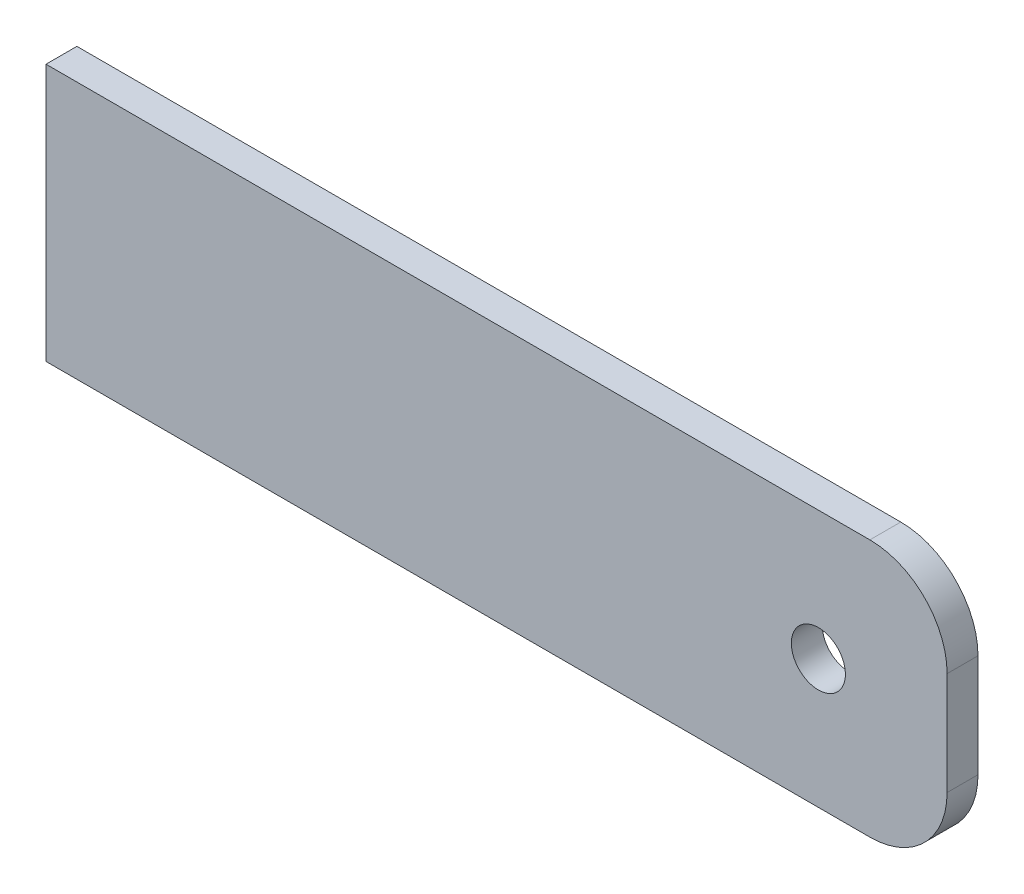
from build123d import *

# Parameters (mm, degrees)
ESQUISSE1_R          = 10.5
BASE_EXTRUSION_DEPTH = 12


with BuildPart() as part:
    # Esquisse1 → Base-Extrusion (new body)
    with BuildSketch(Plane.XY):
        with BuildLine():
            Line((0, 0), (320, 0))
            ThreePointArc((320, 0), (341.213203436, -8.786796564), (350, -30))
            Line((350, -30), (350, -70))
            ThreePointArc((350, -70), (341.213203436, -91.213203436), (320, -100))
            Line((320, -100), (0, -100))
            Line((0, -100), (0, 0))
        make_face()
        with Locations((300, -50)):
            Circle(ESQUISSE1_R, mode=Mode.SUBTRACT)
    extrude(amount=BASE_EXTRUSION_DEPTH)


solid = part.part
